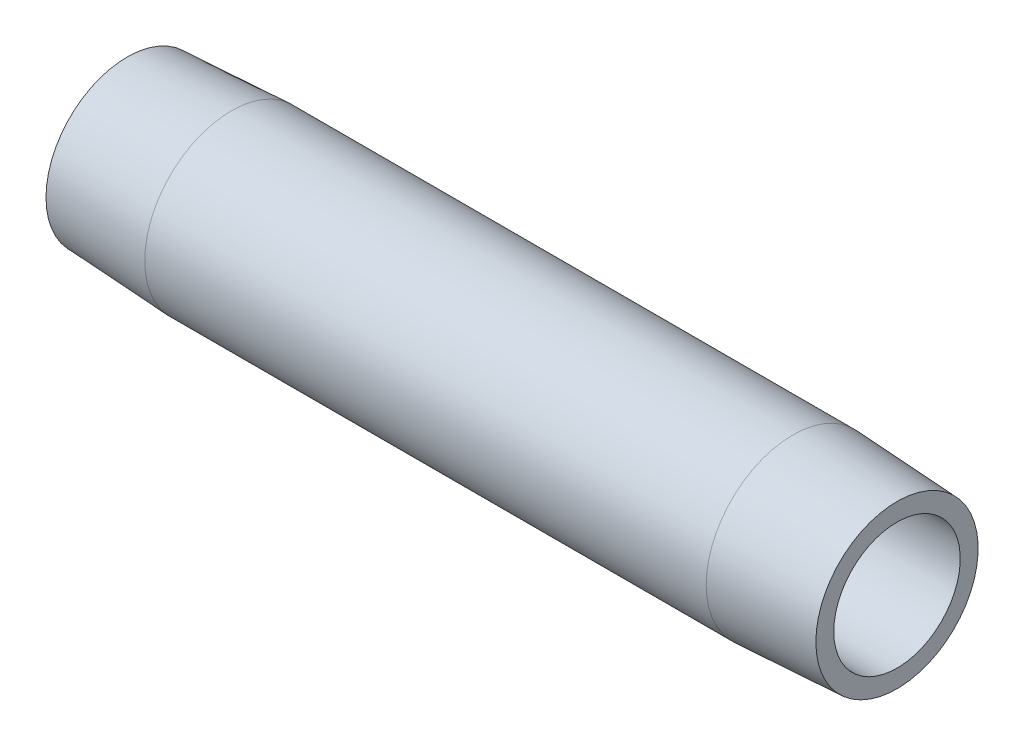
ISO-10303-21;
HEADER;
FILE_DESCRIPTION(('STEP AP214'),'2;1');
FILE_NAME('part.step','',(''),(''),'','','');
FILE_SCHEMA(('AUTOMOTIVE_DESIGN { 1 0 10303 214 1 1 1 1 }'));
ENDSEC;
DATA;
#1=APPLICATION_CONTEXT('core data for automotive mechanical design processes');
#2=APPLICATION_PROTOCOL_DEFINITION('international standard','automotive_design',2000,#1);
#3=PRODUCT_CONTEXT('',#1,'mechanical');
#4=PRODUCT('Part','Part','',(#3));
#5=PRODUCT_RELATED_PRODUCT_CATEGORY('part','',(#4));
#6=PRODUCT_DEFINITION_FORMATION('','',#4);
#7=PRODUCT_DEFINITION_CONTEXT('part definition',#1,'design');
#8=PRODUCT_DEFINITION('design','',#6,#7);
#9=PRODUCT_DEFINITION_SHAPE('','',#8);
#10=(LENGTH_UNIT() NAMED_UNIT(*) SI_UNIT(.MILLI.,.METRE.));
#11=(NAMED_UNIT(*) PLANE_ANGLE_UNIT() SI_UNIT($,.RADIAN.));
#12=(NAMED_UNIT(*) SI_UNIT($,.STERADIAN.) SOLID_ANGLE_UNIT());
#13=UNCERTAINTY_MEASURE_WITH_UNIT(LENGTH_MEASURE(1.E-05),#10,'distance_accuracy_value','');
#14=(GEOMETRIC_REPRESENTATION_CONTEXT(3) GLOBAL_UNCERTAINTY_ASSIGNED_CONTEXT((#13)) GLOBAL_UNIT_ASSIGNED_CONTEXT((#10,
#11,#12)) REPRESENTATION_CONTEXT('',''));
#15=CARTESIAN_POINT('',(0.,0.,0.));
#16=DIRECTION('',(0.,0.,1.));
#17=DIRECTION('',(1.,0.,0.));
#18=AXIS2_PLACEMENT_3D('',#15,#16,#17);
#19=CARTESIAN_POINT('',(76.2,6.26110000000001,0.));
#20=DIRECTION('',(-1.,0.,0.));
#21=DIRECTION('',(0.,0.,1.));
#22=AXIS2_PLACEMENT_3D('',#19,#20,#21);
#23=PLANE('',#22);
#24=CARTESIAN_POINT('',(76.2,0.,0.));
#25=DIRECTION('',(-1.,0.,0.));
#26=DIRECTION('',(0.,0.,1.));
#27=AXIS2_PLACEMENT_3D('',#24,#25,#26);
#28=CIRCLE('',#27,8.03205001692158);
#29=CARTESIAN_POINT('',(76.2,0.,8.03205001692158));
#30=VERTEX_POINT('',#29);
#31=EDGE_CURVE('E10',#30,#30,#28,.T.);
#32=ORIENTED_EDGE('',*,*,#31,.F.);
#33=EDGE_LOOP('',(#32));
#34=FACE_BOUND('',#33,.T.);
#35=CARTESIAN_POINT('',(76.2,0.,0.));
#36=DIRECTION('',(-1.,0.,0.));
#37=DIRECTION('',(0.,0.,1.));
#38=AXIS2_PLACEMENT_3D('',#35,#36,#37);
#39=CIRCLE('',#38,6.26110000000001);
#40=CARTESIAN_POINT('',(76.2,0.,6.26110000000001));
#41=VERTEX_POINT('',#40);
#42=EDGE_CURVE('E52',#41,#41,#39,.T.);
#43=ORIENTED_EDGE('',*,*,#42,.T.);
#44=EDGE_LOOP('',(#43));
#45=FACE_BOUND('',#44,.T.);
#46=ADVANCED_FACE('F30',(#34,#45),#23,.F.);
#47=CARTESIAN_POINT('',(76.2,0.,0.));
#48=DIRECTION('',(-1.,0.,0.));
#49=DIRECTION('',(0.,0.,1.));
#50=AXIS2_PLACEMENT_3D('',#47,#48,#49);
#51=CONICAL_SURFACE('',#50,8.03205001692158,0.0523598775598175);
#52=CARTESIAN_POINT('',(65.8876,0.,0.));
#53=DIRECTION('',(-1.,0.,0.));
#54=DIRECTION('',(0.,0.,1.));
#55=AXIS2_PLACEMENT_3D('',#52,#53,#54);
#56=CIRCLE('',#55,8.57249999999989);
#57=CARTESIAN_POINT('',(65.8876,0.,8.57249999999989));
#58=VERTEX_POINT('',#57);
#59=EDGE_CURVE('E36',#58,#58,#56,.T.);
#60=ORIENTED_EDGE('',*,*,#59,.F.);
#61=EDGE_LOOP('',(#60));
#62=FACE_BOUND('',#61,.T.);
#63=ORIENTED_EDGE('',*,*,#31,.T.);
#64=EDGE_LOOP('',(#63));
#65=FACE_BOUND('',#64,.T.);
#66=ADVANCED_FACE('F77',(#62,#65),#51,.T.);
#67=CARTESIAN_POINT('',(0.,0.,0.));
#68=DIRECTION('',(-1.,0.,0.));
#69=DIRECTION('',(0.,0.,1.));
#70=AXIS2_PLACEMENT_3D('',#67,#68,#69);
#71=CYLINDRICAL_SURFACE('',#70,8.57249999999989);
#72=CARTESIAN_POINT('',(10.3124,0.,0.));
#73=DIRECTION('',(-1.,0.,0.));
#74=DIRECTION('',(0.,0.,1.));
#75=AXIS2_PLACEMENT_3D('',#72,#73,#74);
#76=CIRCLE('',#75,8.57249999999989);
#77=CARTESIAN_POINT('',(10.3124,0.,8.57249999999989));
#78=VERTEX_POINT('',#77);
#79=EDGE_CURVE('E40',#78,#78,#76,.T.);
#80=ORIENTED_EDGE('',*,*,#79,.F.);
#81=EDGE_LOOP('',(#80));
#82=FACE_BOUND('',#81,.T.);
#83=ORIENTED_EDGE('',*,*,#59,.T.);
#84=EDGE_LOOP('',(#83));
#85=FACE_BOUND('',#84,.T.);
#86=ADVANCED_FACE('F72',(#82,#85),#71,.T.);
#87=CARTESIAN_POINT('',(10.3124,0.,0.));
#88=DIRECTION('',(1.,0.,0.));
#89=DIRECTION('',(0.,0.,-1.));
#90=AXIS2_PLACEMENT_3D('',#87,#88,#89);
#91=CONICAL_SURFACE('',#90,8.57249999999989,0.0523598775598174);
#92=CARTESIAN_POINT('',(0.,0.,0.));
#93=DIRECTION('',(-1.,0.,0.));
#94=DIRECTION('',(0.,0.,1.));
#95=AXIS2_PLACEMENT_3D('',#92,#93,#94);
#96=CIRCLE('',#95,8.03205001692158);
#97=CARTESIAN_POINT('',(0.,0.,8.03205001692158));
#98=VERTEX_POINT('',#97);
#99=EDGE_CURVE('E44',#98,#98,#96,.T.);
#100=ORIENTED_EDGE('',*,*,#99,.F.);
#101=EDGE_LOOP('',(#100));
#102=FACE_BOUND('',#101,.T.);
#103=ORIENTED_EDGE('',*,*,#79,.T.);
#104=EDGE_LOOP('',(#103));
#105=FACE_BOUND('',#104,.T.);
#106=ADVANCED_FACE('F66',(#102,#105),#91,.T.);
#107=CARTESIAN_POINT('',(0.,6.26110000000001,0.));
#108=DIRECTION('',(1.,0.,0.));
#109=DIRECTION('',(0.,0.,-1.));
#110=AXIS2_PLACEMENT_3D('',#107,#108,#109);
#111=PLANE('',#110);
#112=CARTESIAN_POINT('',(0.,0.,0.));
#113=DIRECTION('',(-1.,0.,0.));
#114=DIRECTION('',(0.,0.,1.));
#115=AXIS2_PLACEMENT_3D('',#112,#113,#114);
#116=CIRCLE('',#115,6.26110000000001);
#117=CARTESIAN_POINT('',(0.,0.,6.26110000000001));
#118=VERTEX_POINT('',#117);
#119=EDGE_CURVE('E49',#118,#118,#116,.T.);
#120=ORIENTED_EDGE('',*,*,#119,.F.);
#121=EDGE_LOOP('',(#120));
#122=FACE_BOUND('',#121,.T.);
#123=ORIENTED_EDGE('',*,*,#99,.T.);
#124=EDGE_LOOP('',(#123));
#125=FACE_BOUND('',#124,.T.);
#126=ADVANCED_FACE('F60',(#122,#125),#111,.F.);
#127=CARTESIAN_POINT('',(0.,0.,0.));
#128=DIRECTION('',(-1.,0.,0.));
#129=DIRECTION('',(0.,0.,1.));
#130=AXIS2_PLACEMENT_3D('',#127,#128,#129);
#131=CYLINDRICAL_SURFACE('',#130,6.26110000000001);
#132=ORIENTED_EDGE('',*,*,#42,.F.);
#133=EDGE_LOOP('',(#132));
#134=FACE_BOUND('',#133,.T.);
#135=ORIENTED_EDGE('',*,*,#119,.T.);
#136=EDGE_LOOP('',(#135));
#137=FACE_BOUND('',#136,.T.);
#138=ADVANCED_FACE('F57',(#134,#137),#131,.F.);
#139=CLOSED_SHELL('',(#46,#66,#86,#106,#126,#138));
#140=MANIFOLD_SOLID_BREP('B2',#139);
#141=ADVANCED_BREP_SHAPE_REPRESENTATION('',(#18,#140),#14);
#142=SHAPE_DEFINITION_REPRESENTATION(#9,#141);
ENDSEC;
END-ISO-10303-21;
